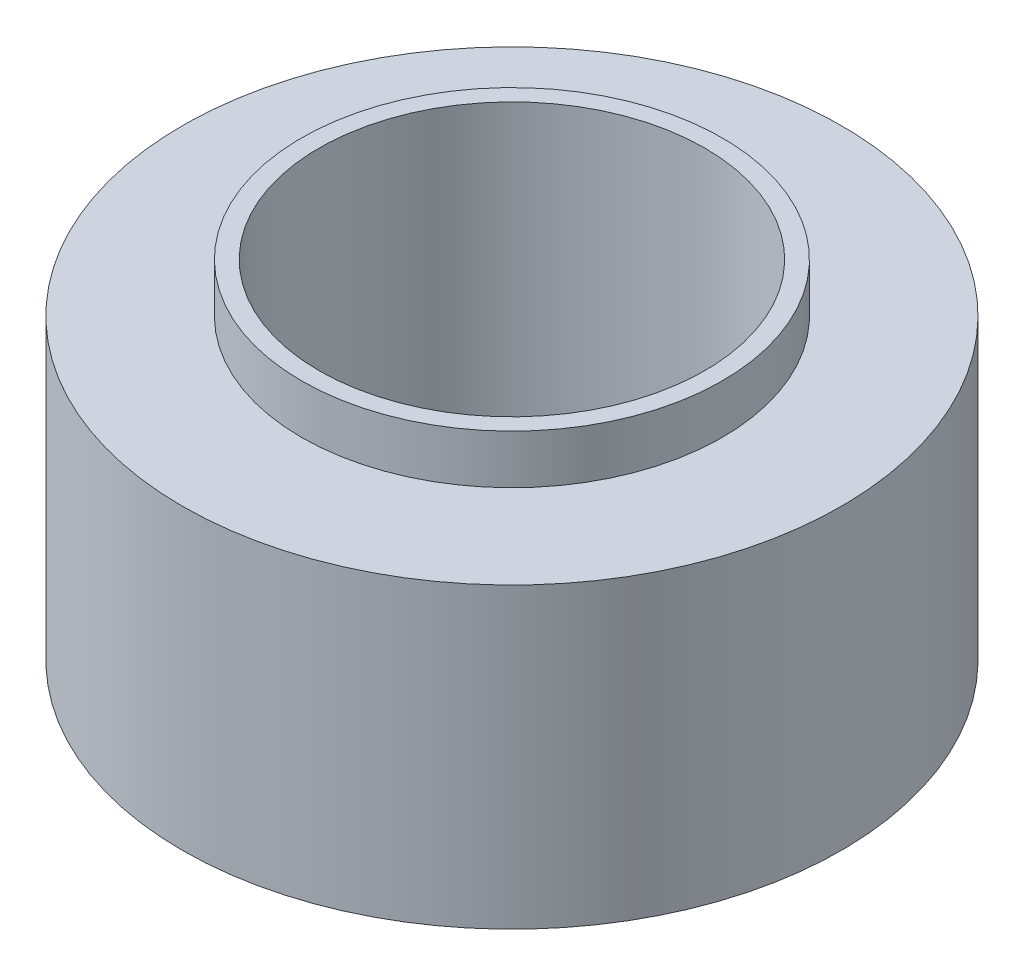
ISO-10303-21;
HEADER;
FILE_DESCRIPTION(('STEP AP214'),'2;1');
FILE_NAME('part.step','',(''),(''),'','','');
FILE_SCHEMA(('AUTOMOTIVE_DESIGN { 1 0 10303 214 1 1 1 1 }'));
ENDSEC;
DATA;
#1=APPLICATION_CONTEXT('core data for automotive mechanical design processes');
#2=APPLICATION_PROTOCOL_DEFINITION('international standard','automotive_design',2000,#1);
#3=PRODUCT_CONTEXT('',#1,'mechanical');
#4=PRODUCT('Part','Part','',(#3));
#5=PRODUCT_RELATED_PRODUCT_CATEGORY('part','',(#4));
#6=PRODUCT_DEFINITION_FORMATION('','',#4);
#7=PRODUCT_DEFINITION_CONTEXT('part definition',#1,'design');
#8=PRODUCT_DEFINITION('design','',#6,#7);
#9=PRODUCT_DEFINITION_SHAPE('','',#8);
#10=(LENGTH_UNIT() NAMED_UNIT(*) SI_UNIT(.MILLI.,.METRE.));
#11=(NAMED_UNIT(*) PLANE_ANGLE_UNIT() SI_UNIT($,.RADIAN.));
#12=(NAMED_UNIT(*) SI_UNIT($,.STERADIAN.) SOLID_ANGLE_UNIT());
#13=UNCERTAINTY_MEASURE_WITH_UNIT(LENGTH_MEASURE(1.E-05),#10,'distance_accuracy_value','');
#14=(GEOMETRIC_REPRESENTATION_CONTEXT(3) GLOBAL_UNCERTAINTY_ASSIGNED_CONTEXT((#13)) GLOBAL_UNIT_ASSIGNED_CONTEXT((#10,
#11,#12)) REPRESENTATION_CONTEXT('',''));
#15=CARTESIAN_POINT('',(0.,0.,0.));
#16=DIRECTION('',(0.,0.,1.));
#17=DIRECTION('',(1.,0.,0.));
#18=AXIS2_PLACEMENT_3D('',#15,#16,#17);
#19=CARTESIAN_POINT('',(0.,8.5,0.));
#20=DIRECTION('',(0.,1.,0.));
#21=DIRECTION('',(0.,0.,1.));
#22=AXIS2_PLACEMENT_3D('',#19,#20,#21);
#23=PLANE('',#22);
#24=CARTESIAN_POINT('',(0.,8.5,0.));
#25=DIRECTION('',(0.,1.,0.));
#26=DIRECTION('',(0.,0.,1.));
#27=AXIS2_PLACEMENT_3D('',#24,#25,#26);
#28=CIRCLE('',#27,9.398);
#29=CARTESIAN_POINT('',(0.,8.5,9.398));
#30=VERTEX_POINT('',#29);
#31=EDGE_CURVE('E11',#30,#30,#28,.T.);
#32=ORIENTED_EDGE('',*,*,#31,.T.);
#33=EDGE_LOOP('',(#32));
#34=FACE_BOUND('',#33,.T.);
#35=CARTESIAN_POINT('',(0.,8.5,0.));
#36=DIRECTION('',(0.,1.,0.));
#37=DIRECTION('',(0.,0.,1.));
#38=AXIS2_PLACEMENT_3D('',#35,#36,#37);
#39=CIRCLE('',#38,6.);
#40=CARTESIAN_POINT('',(0.,8.5,6.));
#41=VERTEX_POINT('',#40);
#42=EDGE_CURVE('E75',#41,#41,#39,.T.);
#43=ORIENTED_EDGE('',*,*,#42,.F.);
#44=EDGE_LOOP('',(#43));
#45=FACE_BOUND('',#44,.T.);
#46=ADVANCED_FACE('F56',(#34,#45),#23,.T.);
#47=CARTESIAN_POINT('',(0.,0.,0.));
#48=DIRECTION('',(0.,1.,0.));
#49=DIRECTION('',(0.,0.,1.));
#50=AXIS2_PLACEMENT_3D('',#47,#48,#49);
#51=PLANE('',#50);
#52=CARTESIAN_POINT('',(0.,0.,0.));
#53=DIRECTION('',(0.,1.,0.));
#54=DIRECTION('',(0.,0.,1.));
#55=AXIS2_PLACEMENT_3D('',#52,#53,#54);
#56=CIRCLE('',#55,9.398);
#57=CARTESIAN_POINT('',(0.,0.,9.398));
#58=VERTEX_POINT('',#57);
#59=EDGE_CURVE('E60',#58,#58,#56,.T.);
#60=ORIENTED_EDGE('',*,*,#59,.F.);
#61=EDGE_LOOP('',(#60));
#62=FACE_BOUND('',#61,.T.);
#63=CARTESIAN_POINT('',(0.,0.,0.));
#64=DIRECTION('',(0.,1.,0.));
#65=DIRECTION('',(0.,0.,1.));
#66=AXIS2_PLACEMENT_3D('',#63,#64,#65);
#67=CIRCLE('',#66,5.5);
#68=CARTESIAN_POINT('',(0.,0.,5.5));
#69=VERTEX_POINT('',#68);
#70=EDGE_CURVE('E69',#69,#69,#67,.T.);
#71=ORIENTED_EDGE('',*,*,#70,.T.);
#72=EDGE_LOOP('',(#71));
#73=FACE_BOUND('',#72,.T.);
#74=ADVANCED_FACE('F103',(#62,#73),#51,.F.);
#75=CARTESIAN_POINT('',(0.,8.5,0.));
#76=DIRECTION('',(0.,-1.,0.));
#77=DIRECTION('',(0.,0.,-1.));
#78=AXIS2_PLACEMENT_3D('',#75,#76,#77);
#79=CYLINDRICAL_SURFACE('',#78,9.398);
#80=ORIENTED_EDGE('',*,*,#31,.F.);
#81=EDGE_LOOP('',(#80));
#82=FACE_BOUND('',#81,.T.);
#83=ORIENTED_EDGE('',*,*,#59,.T.);
#84=EDGE_LOOP('',(#83));
#85=FACE_BOUND('',#84,.T.);
#86=ADVANCED_FACE('F58',(#82,#85),#79,.T.);
#87=CARTESIAN_POINT('',(0.,8.5,0.));
#88=DIRECTION('',(0.,-1.,0.));
#89=DIRECTION('',(0.,0.,-1.));
#90=AXIS2_PLACEMENT_3D('',#87,#88,#89);
#91=CYLINDRICAL_SURFACE('',#90,5.5);
#92=ORIENTED_EDGE('',*,*,#70,.F.);
#93=EDGE_LOOP('',(#92));
#94=FACE_BOUND('',#93,.T.);
#95=CARTESIAN_POINT('',(0.,9.897,0.));
#96=DIRECTION('',(0.,1.,0.));
#97=DIRECTION('',(0.,0.,1.));
#98=AXIS2_PLACEMENT_3D('',#95,#96,#97);
#99=CIRCLE('',#98,5.5);
#100=CARTESIAN_POINT('',(0.,9.897,5.5));
#101=VERTEX_POINT('',#100);
#102=EDGE_CURVE('E79',#101,#101,#99,.T.);
#103=ORIENTED_EDGE('',*,*,#102,.T.);
#104=EDGE_LOOP('',(#103));
#105=FACE_BOUND('',#104,.T.);
#106=ADVANCED_FACE('F87',(#94,#105),#91,.F.);
#107=CARTESIAN_POINT('',(0.,9.897,0.));
#108=DIRECTION('',(0.,1.,0.));
#109=DIRECTION('',(0.,0.,1.));
#110=AXIS2_PLACEMENT_3D('',#107,#108,#109);
#111=PLANE('',#110);
#112=CARTESIAN_POINT('',(0.,9.897,0.));
#113=DIRECTION('',(0.,1.,0.));
#114=DIRECTION('',(0.,0.,1.));
#115=AXIS2_PLACEMENT_3D('',#112,#113,#114);
#116=CIRCLE('',#115,6.);
#117=CARTESIAN_POINT('',(0.,9.897,6.));
#118=VERTEX_POINT('',#117);
#119=EDGE_CURVE('E74',#118,#118,#116,.T.);
#120=ORIENTED_EDGE('',*,*,#119,.T.);
#121=EDGE_LOOP('',(#120));
#122=FACE_BOUND('',#121,.T.);
#123=ORIENTED_EDGE('',*,*,#102,.F.);
#124=EDGE_LOOP('',(#123));
#125=FACE_BOUND('',#124,.T.);
#126=ADVANCED_FACE('F89',(#122,#125),#111,.T.);
#127=CARTESIAN_POINT('',(0.,9.897,0.));
#128=DIRECTION('',(0.,-1.,0.));
#129=DIRECTION('',(0.,0.,-1.));
#130=AXIS2_PLACEMENT_3D('',#127,#128,#129);
#131=CYLINDRICAL_SURFACE('',#130,6.);
#132=ORIENTED_EDGE('',*,*,#119,.F.);
#133=EDGE_LOOP('',(#132));
#134=FACE_BOUND('',#133,.T.);
#135=ORIENTED_EDGE('',*,*,#42,.T.);
#136=EDGE_LOOP('',(#135));
#137=FACE_BOUND('',#136,.T.);
#138=ADVANCED_FACE('F91',(#134,#137),#131,.T.);
#139=CLOSED_SHELL('',(#46,#74,#86,#106,#126,#138));
#140=MANIFOLD_SOLID_BREP('B2',#139);
#141=ADVANCED_BREP_SHAPE_REPRESENTATION('',(#18,#140),#14);
#142=SHAPE_DEFINITION_REPRESENTATION(#9,#141);
ENDSEC;
END-ISO-10303-21;
